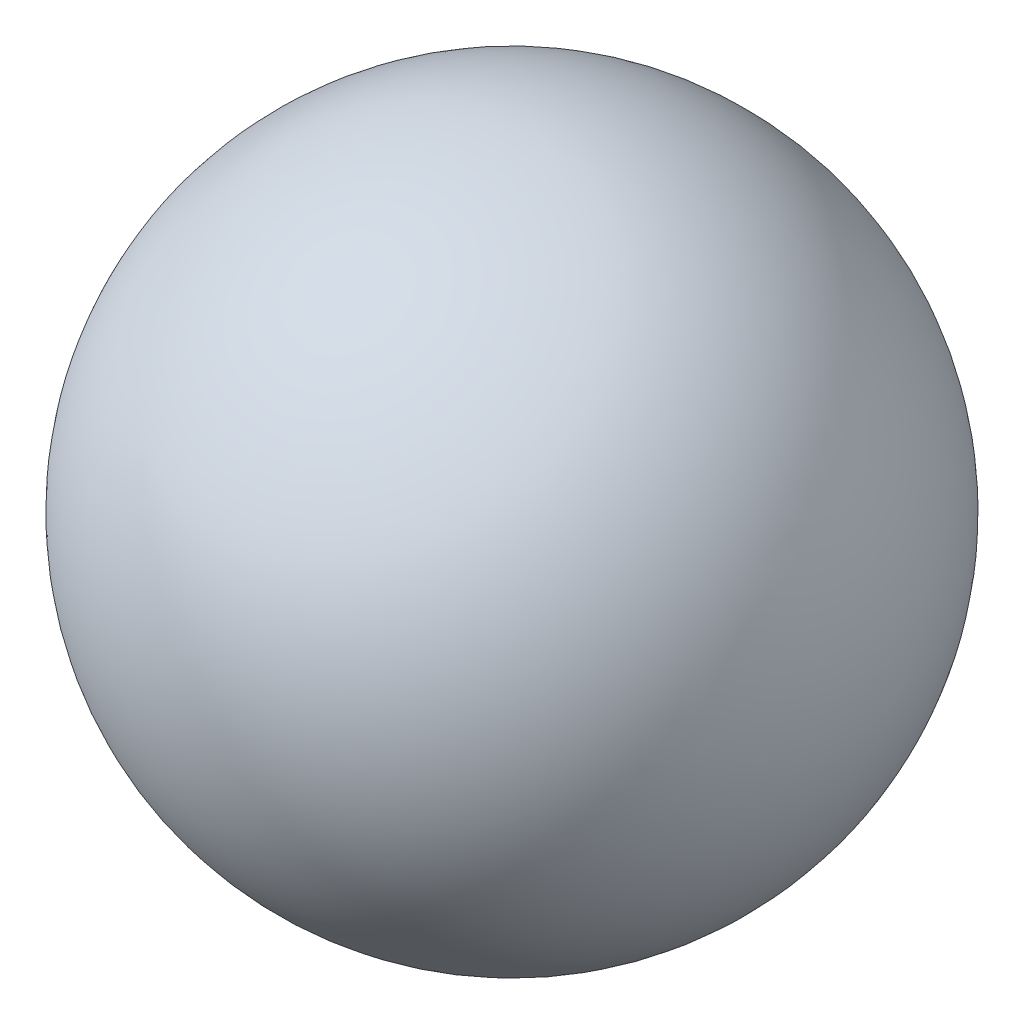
from build123d import *


with BuildPart() as part:
    # Esquisse1 → Base-R_volution (revolve)
    with BuildSketch(Plane.XY):
        with BuildLine():
            Line((7.25, 10), (13.25, 10))
            ThreePointArc((13.25, 10), (10.25, 7), (7.25, 10))
        make_face()
    revolve(axis=Axis((5.312091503, 10, 0), (1, 0, 0)))


solid = part.part
